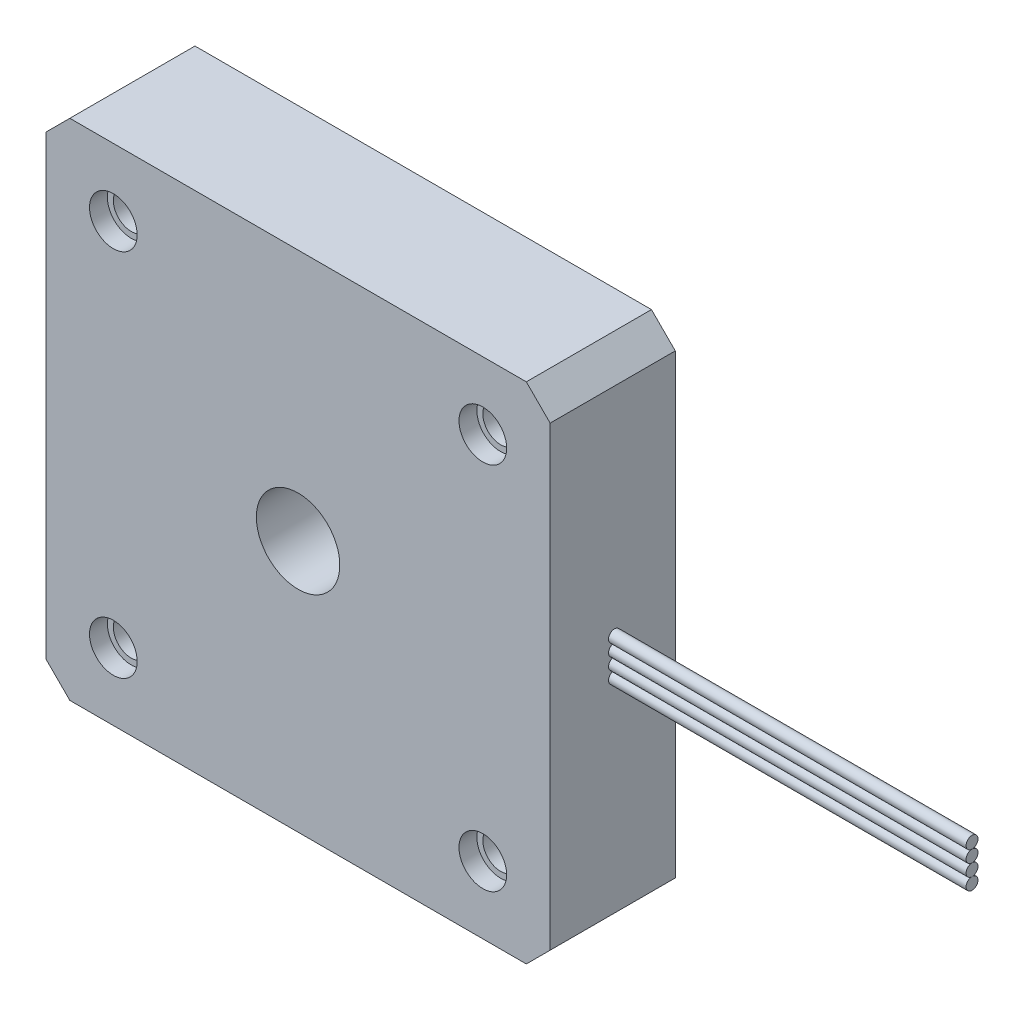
ISO-10303-21;
HEADER;
FILE_DESCRIPTION(('STEP AP214'),'2;1');
FILE_NAME('part.step','',(''),(''),'','','');
FILE_SCHEMA(('AUTOMOTIVE_DESIGN { 1 0 10303 214 1 1 1 1 }'));
ENDSEC;
DATA;
#1=APPLICATION_CONTEXT('core data for automotive mechanical design processes');
#2=APPLICATION_PROTOCOL_DEFINITION('international standard','automotive_design',2000,#1);
#3=PRODUCT_CONTEXT('',#1,'mechanical');
#4=PRODUCT('Part','Part','',(#3));
#5=PRODUCT_RELATED_PRODUCT_CATEGORY('part','',(#4));
#6=PRODUCT_DEFINITION_FORMATION('','',#4);
#7=PRODUCT_DEFINITION_CONTEXT('part definition',#1,'design');
#8=PRODUCT_DEFINITION('design','',#6,#7);
#9=PRODUCT_DEFINITION_SHAPE('','',#8);
#10=(LENGTH_UNIT() NAMED_UNIT(*) SI_UNIT(.MILLI.,.METRE.));
#11=(NAMED_UNIT(*) PLANE_ANGLE_UNIT() SI_UNIT($,.RADIAN.));
#12=(NAMED_UNIT(*) SI_UNIT($,.STERADIAN.) SOLID_ANGLE_UNIT());
#13=UNCERTAINTY_MEASURE_WITH_UNIT(LENGTH_MEASURE(1.E-05),#10,'distance_accuracy_value','');
#14=(GEOMETRIC_REPRESENTATION_CONTEXT(3) GLOBAL_UNCERTAINTY_ASSIGNED_CONTEXT((#13)) GLOBAL_UNIT_ASSIGNED_CONTEXT((#10,
#11,#12)) REPRESENTATION_CONTEXT('',''));
#15=CARTESIAN_POINT('',(0.,0.,0.));
#16=DIRECTION('',(0.,0.,1.));
#17=DIRECTION('',(1.,0.,0.));
#18=AXIS2_PLACEMENT_3D('',#15,#16,#17);
#19=CARTESIAN_POINT('',(51.15,-1.,5.10242147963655));
#20=DIRECTION('',(-1.,0.,0.));
#21=DIRECTION('',(0.,0.,1.));
#22=AXIS2_PLACEMENT_3D('',#19,#20,#21);
#23=CYLINDRICAL_SURFACE('',#22,0.500000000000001);
#24=CARTESIAN_POINT('',(51.15,-1.,5.10242147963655));
#25=DIRECTION('',(1.,0.,0.));
#26=DIRECTION('',(0.,0.,-1.));
#27=AXIS2_PLACEMENT_3D('',#24,#25,#26);
#28=CIRCLE('',#27,0.500000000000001);
#29=CARTESIAN_POINT('',(51.15,-1.,4.60242147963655));
#30=VERTEX_POINT('',#29);
#31=EDGE_CURVE('E11',#30,#30,#28,.T.);
#32=ORIENTED_EDGE('',*,*,#31,.F.);
#33=EDGE_LOOP('',(#32));
#34=FACE_BOUND('',#33,.T.);
#35=CARTESIAN_POINT('',(21.15,-1.,5.10242147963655));
#36=DIRECTION('',(1.,0.,0.));
#37=DIRECTION('',(0.,0.,-1.));
#38=AXIS2_PLACEMENT_3D('',#35,#36,#37);
#39=CIRCLE('',#38,0.500000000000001);
#40=CARTESIAN_POINT('',(21.15,-1.,4.60242147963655));
#41=VERTEX_POINT('',#40);
#42=EDGE_CURVE('E43',#41,#41,#39,.T.);
#43=ORIENTED_EDGE('',*,*,#42,.T.);
#44=EDGE_LOOP('',(#43));
#45=FACE_BOUND('',#44,.T.);
#46=ADVANCED_FACE('F40',(#34,#45),#23,.T.);
#47=CARTESIAN_POINT('',(51.15,-1.,5.10242147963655));
#48=DIRECTION('',(1.,0.,0.));
#49=DIRECTION('',(0.,0.,-1.));
#50=AXIS2_PLACEMENT_3D('',#47,#48,#49);
#51=PLANE('',#50);
#52=ORIENTED_EDGE('',*,*,#31,.T.);
#53=EDGE_LOOP('',(#52));
#54=FACE_BOUND('',#53,.T.);
#55=ADVANCED_FACE('F55',(#54),#51,.T.);
#56=CARTESIAN_POINT('',(21.15,-1.,5.10242147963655));
#57=DIRECTION('',(1.,0.,0.));
#58=DIRECTION('',(0.,0.,-1.));
#59=AXIS2_PLACEMENT_3D('',#56,#57,#58);
#60=PLANE('',#59);
#61=ORIENTED_EDGE('',*,*,#42,.F.);
#62=EDGE_LOOP('',(#61));
#63=FACE_BOUND('',#62,.T.);
#64=ADVANCED_FACE('F53',(#63),#60,.F.);
#65=CLOSED_SHELL('',(#46,#55,#64));
#66=MANIFOLD_SOLID_BREP('B2',#65);
#67=CARTESIAN_POINT('',(51.15,0.,5.10242147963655));
#68=DIRECTION('',(-1.,0.,0.));
#69=DIRECTION('',(0.,0.,1.));
#70=AXIS2_PLACEMENT_3D('',#67,#68,#69);
#71=CYLINDRICAL_SURFACE('',#70,0.500000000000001);
#72=CARTESIAN_POINT('',(51.15,0.,5.10242147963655));
#73=DIRECTION('',(1.,0.,0.));
#74=DIRECTION('',(0.,0.,-1.));
#75=AXIS2_PLACEMENT_3D('',#72,#73,#74);
#76=CIRCLE('',#75,0.500000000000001);
#77=CARTESIAN_POINT('',(51.15,0.,4.60242147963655));
#78=VERTEX_POINT('',#77);
#79=EDGE_CURVE('E39',#78,#78,#76,.T.);
#80=ORIENTED_EDGE('',*,*,#79,.F.);
#81=EDGE_LOOP('',(#80));
#82=FACE_BOUND('',#81,.T.);
#83=CARTESIAN_POINT('',(21.15,0.,5.10242147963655));
#84=DIRECTION('',(1.,0.,0.));
#85=DIRECTION('',(0.,0.,-1.));
#86=AXIS2_PLACEMENT_3D('',#83,#84,#85);
#87=CIRCLE('',#86,0.500000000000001);
#88=CARTESIAN_POINT('',(21.15,0.,4.60242147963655));
#89=VERTEX_POINT('',#88);
#90=EDGE_CURVE('E93',#89,#89,#87,.T.);
#91=ORIENTED_EDGE('',*,*,#90,.T.);
#92=EDGE_LOOP('',(#91));
#93=FACE_BOUND('',#92,.T.);
#94=ADVANCED_FACE('F90',(#82,#93),#71,.T.);
#95=CARTESIAN_POINT('',(51.15,0.,5.10242147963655));
#96=DIRECTION('',(1.,0.,0.));
#97=DIRECTION('',(0.,0.,-1.));
#98=AXIS2_PLACEMENT_3D('',#95,#96,#97);
#99=PLANE('',#98);
#100=ORIENTED_EDGE('',*,*,#79,.T.);
#101=EDGE_LOOP('',(#100));
#102=FACE_BOUND('',#101,.T.);
#103=ADVANCED_FACE('F105',(#102),#99,.T.);
#104=CARTESIAN_POINT('',(21.15,0.,5.10242147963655));
#105=DIRECTION('',(1.,0.,0.));
#106=DIRECTION('',(0.,0.,-1.));
#107=AXIS2_PLACEMENT_3D('',#104,#105,#106);
#108=PLANE('',#107);
#109=ORIENTED_EDGE('',*,*,#90,.F.);
#110=EDGE_LOOP('',(#109));
#111=FACE_BOUND('',#110,.T.);
#112=ADVANCED_FACE('F103',(#111),#108,.F.);
#113=CLOSED_SHELL('',(#94,#103,#112));
#114=MANIFOLD_SOLID_BREP('B6',#113);
#115=CARTESIAN_POINT('',(21.15,-19.15,10.5));
#116=DIRECTION('',(-1.,0.,0.));
#117=DIRECTION('',(0.,0.,1.));
#118=AXIS2_PLACEMENT_3D('',#115,#116,#117);
#119=PLANE('',#118);
#120=CARTESIAN_POINT('',(21.15,-2.,5.10242147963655));
#121=DIRECTION('',(-1.,0.,0.));
#122=DIRECTION('',(0.,0.,1.));
#123=AXIS2_PLACEMENT_3D('',#120,#121,#122);
#124=CIRCLE('',#123,0.500000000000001);
#125=CARTESIAN_POINT('',(21.15,-2.,5.60242147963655));
#126=VERTEX_POINT('',#125);
#127=EDGE_CURVE('E140',#126,#126,#124,.F.);
#128=ORIENTED_EDGE('',*,*,#127,.F.);
#129=EDGE_LOOP('',(#128));
#130=FACE_BOUND('',#129,.T.);
#131=DIRECTION('',(0.,1.,0.));
#132=VECTOR('',#131,1.);
#133=CARTESIAN_POINT('',(21.15,-19.15,0.));
#134=LINE('',#133,#132);
#135=CARTESIAN_POINT('',(21.15,-19.15,0.));
#136=VERTEX_POINT('',#135);
#137=CARTESIAN_POINT('',(21.15,19.15,0.));
#138=VERTEX_POINT('',#137);
#139=EDGE_CURVE('E239',#136,#138,#134,.T.);
#140=ORIENTED_EDGE('',*,*,#139,.T.);
#141=DIRECTION('',(0.,0.,-1.));
#142=VECTOR('',#141,1.);
#143=CARTESIAN_POINT('',(21.15,19.15,10.5));
#144=LINE('',#143,#142);
#145=CARTESIAN_POINT('',(21.15,19.15,10.5));
#146=VERTEX_POINT('',#145);
#147=EDGE_CURVE('E220',#146,#138,#144,.T.);
#148=ORIENTED_EDGE('',*,*,#147,.F.);
#149=DIRECTION('',(0.,1.,0.));
#150=VECTOR('',#149,1.);
#151=CARTESIAN_POINT('',(21.15,-19.15,10.5));
#152=LINE('',#151,#150);
#153=CARTESIAN_POINT('',(21.15,-19.15,10.5));
#154=VERTEX_POINT('',#153);
#155=EDGE_CURVE('E211',#154,#146,#152,.T.);
#156=ORIENTED_EDGE('',*,*,#155,.F.);
#157=DIRECTION('',(0.,0.,-1.));
#158=VECTOR('',#157,1.);
#159=CARTESIAN_POINT('',(21.15,-19.15,10.5));
#160=LINE('',#159,#158);
#161=EDGE_CURVE('E248',#154,#136,#160,.T.);
#162=ORIENTED_EDGE('',*,*,#161,.T.);
#163=EDGE_LOOP('',(#140,#148,#156,#162));
#164=FACE_BOUND('',#163,.T.);
#165=CARTESIAN_POINT('',(21.15,1.,5.10242147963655));
#166=DIRECTION('',(-1.,0.,0.));
#167=DIRECTION('',(0.,0.,1.));
#168=AXIS2_PLACEMENT_3D('',#165,#166,#167);
#169=CIRCLE('',#168,0.500000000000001);
#170=CARTESIAN_POINT('',(21.15,1.,5.60242147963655));
#171=VERTEX_POINT('',#170);
#172=EDGE_CURVE('E88',#171,#171,#169,.F.);
#173=ORIENTED_EDGE('',*,*,#172,.F.);
#174=EDGE_LOOP('',(#173));
#175=FACE_BOUND('',#174,.T.);
#176=ADVANCED_FACE('F131',(#130,#164,#175),#119,.F.);
#177=CARTESIAN_POINT('',(-21.15,-19.15,10.5));
#178=DIRECTION('',(1.,0.,0.));
#179=DIRECTION('',(0.,0.,-1.));
#180=AXIS2_PLACEMENT_3D('',#177,#178,#179);
#181=PLANE('',#180);
#182=DIRECTION('',(0.,-1.,0.));
#183=VECTOR('',#182,1.);
#184=CARTESIAN_POINT('',(-21.15,-19.15,0.));
#185=LINE('',#184,#183);
#186=CARTESIAN_POINT('',(-21.15,19.15,0.));
#187=VERTEX_POINT('',#186);
#188=CARTESIAN_POINT('',(-21.15,-19.15,0.));
#189=VERTEX_POINT('',#188);
#190=EDGE_CURVE('E229',#187,#189,#185,.T.);
#191=ORIENTED_EDGE('',*,*,#190,.T.);
#192=DIRECTION('',(0.,0.,-1.));
#193=VECTOR('',#192,1.);
#194=CARTESIAN_POINT('',(-21.15,-19.15,10.5));
#195=LINE('',#194,#193);
#196=CARTESIAN_POINT('',(-21.15,-19.15,10.5));
#197=VERTEX_POINT('',#196);
#198=EDGE_CURVE('E257',#197,#189,#195,.T.);
#199=ORIENTED_EDGE('',*,*,#198,.F.);
#200=DIRECTION('',(0.,-1.,0.));
#201=VECTOR('',#200,1.);
#202=CARTESIAN_POINT('',(-21.15,-19.15,10.5));
#203=LINE('',#202,#201);
#204=CARTESIAN_POINT('',(-21.15,19.15,10.5));
#205=VERTEX_POINT('',#204);
#206=EDGE_CURVE('E244',#205,#197,#203,.T.);
#207=ORIENTED_EDGE('',*,*,#206,.F.);
#208=DIRECTION('',(0.,0.,-1.));
#209=VECTOR('',#208,1.);
#210=CARTESIAN_POINT('',(-21.15,19.15,10.5));
#211=LINE('',#210,#209);
#212=EDGE_CURVE('E225',#205,#187,#211,.T.);
#213=ORIENTED_EDGE('',*,*,#212,.T.);
#214=EDGE_LOOP('',(#191,#199,#207,#213));
#215=FACE_BOUND('',#214,.T.);
#216=ADVANCED_FACE('F133',(#215),#181,.F.);
#217=CARTESIAN_POINT('',(-21.15,-19.15,10.5));
#218=DIRECTION('',(0.707106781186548,0.707106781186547,0.));
#219=DIRECTION('',(-0.707106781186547,0.707106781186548,0.));
#220=AXIS2_PLACEMENT_3D('',#217,#218,#219);
#221=PLANE('',#220);
#222=DIRECTION('',(0.707106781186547,-0.707106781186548,0.));
#223=VECTOR('',#222,1.);
#224=CARTESIAN_POINT('',(-21.15,-19.15,0.));
#225=LINE('',#224,#223);
#226=CARTESIAN_POINT('',(-19.15,-21.15,0.));
#227=VERTEX_POINT('',#226);
#228=EDGE_CURVE('E232',#189,#227,#225,.T.);
#229=ORIENTED_EDGE('',*,*,#228,.T.);
#230=DIRECTION('',(0.,0.,-1.));
#231=VECTOR('',#230,1.);
#232=CARTESIAN_POINT('',(-19.15,-21.15,10.5));
#233=LINE('',#232,#231);
#234=CARTESIAN_POINT('',(-19.15,-21.15,10.5));
#235=VERTEX_POINT('',#234);
#236=EDGE_CURVE('E254',#235,#227,#233,.T.);
#237=ORIENTED_EDGE('',*,*,#236,.F.);
#238=DIRECTION('',(0.707106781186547,-0.707106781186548,0.));
#239=VECTOR('',#238,1.);
#240=CARTESIAN_POINT('',(-21.15,-19.15,10.5));
#241=LINE('',#240,#239);
#242=EDGE_CURVE('E192',#197,#235,#241,.T.);
#243=ORIENTED_EDGE('',*,*,#242,.F.);
#244=ORIENTED_EDGE('',*,*,#198,.T.);
#245=EDGE_LOOP('',(#229,#237,#243,#244));
#246=FACE_BOUND('',#245,.T.);
#247=ADVANCED_FACE('F372',(#246),#221,.F.);
#248=CARTESIAN_POINT('',(19.15,-21.15,10.5));
#249=DIRECTION('',(0.,1.,0.));
#250=DIRECTION('',(-1.,0.,0.));
#251=AXIS2_PLACEMENT_3D('',#248,#249,#250);
#252=PLANE('',#251);
#253=DIRECTION('',(1.,0.,0.));
#254=VECTOR('',#253,1.);
#255=CARTESIAN_POINT('',(19.15,-21.15,0.));
#256=LINE('',#255,#254);
#257=CARTESIAN_POINT('',(19.15,-21.15,0.));
#258=VERTEX_POINT('',#257);
#259=EDGE_CURVE('E235',#227,#258,#256,.T.);
#260=ORIENTED_EDGE('',*,*,#259,.T.);
#261=DIRECTION('',(0.,0.,-1.));
#262=VECTOR('',#261,1.);
#263=CARTESIAN_POINT('',(19.15,-21.15,10.5));
#264=LINE('',#263,#262);
#265=CARTESIAN_POINT('',(19.15,-21.15,10.5));
#266=VERTEX_POINT('',#265);
#267=EDGE_CURVE('E251',#266,#258,#264,.T.);
#268=ORIENTED_EDGE('',*,*,#267,.F.);
#269=DIRECTION('',(1.,0.,0.));
#270=VECTOR('',#269,1.);
#271=CARTESIAN_POINT('',(19.15,-21.15,10.5));
#272=LINE('',#271,#270);
#273=EDGE_CURVE('E385',#235,#266,#272,.T.);
#274=ORIENTED_EDGE('',*,*,#273,.F.);
#275=ORIENTED_EDGE('',*,*,#236,.T.);
#276=EDGE_LOOP('',(#260,#268,#274,#275));
#277=FACE_BOUND('',#276,.T.);
#278=ADVANCED_FACE('F369',(#277),#252,.F.);
#279=CARTESIAN_POINT('',(21.15,-19.15,10.5));
#280=DIRECTION('',(-0.707106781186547,0.707106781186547,0.));
#281=DIRECTION('',(-0.707106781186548,-0.707106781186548,0.));
#282=AXIS2_PLACEMENT_3D('',#279,#280,#281);
#283=PLANE('',#282);
#284=DIRECTION('',(0.707106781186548,0.707106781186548,0.));
#285=VECTOR('',#284,1.);
#286=CARTESIAN_POINT('',(21.15,-19.15,0.));
#287=LINE('',#286,#285);
#288=EDGE_CURVE('E237',#258,#136,#287,.T.);
#289=ORIENTED_EDGE('',*,*,#288,.T.);
#290=ORIENTED_EDGE('',*,*,#161,.F.);
#291=DIRECTION('',(0.707106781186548,0.707106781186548,0.));
#292=VECTOR('',#291,1.);
#293=CARTESIAN_POINT('',(21.15,-19.15,10.5));
#294=LINE('',#293,#292);
#295=EDGE_CURVE('E389',#266,#154,#294,.T.);
#296=ORIENTED_EDGE('',*,*,#295,.F.);
#297=ORIENTED_EDGE('',*,*,#267,.T.);
#298=EDGE_LOOP('',(#289,#290,#296,#297));
#299=FACE_BOUND('',#298,.T.);
#300=ADVANCED_FACE('F365',(#299),#283,.F.);
#301=CARTESIAN_POINT('',(19.15,21.15,10.5));
#302=DIRECTION('',(-0.707106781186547,-0.707106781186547,0.));
#303=DIRECTION('',(0.707106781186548,-0.707106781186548,0.));
#304=AXIS2_PLACEMENT_3D('',#301,#302,#303);
#305=PLANE('',#304);
#306=DIRECTION('',(-0.707106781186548,0.707106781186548,0.));
#307=VECTOR('',#306,1.);
#308=CARTESIAN_POINT('',(19.15,21.15,0.));
#309=LINE('',#308,#307);
#310=CARTESIAN_POINT('',(19.15,21.15,0.));
#311=VERTEX_POINT('',#310);
#312=EDGE_CURVE('E219',#138,#311,#309,.T.);
#313=ORIENTED_EDGE('',*,*,#312,.T.);
#314=DIRECTION('',(0.,0.,-1.));
#315=VECTOR('',#314,1.);
#316=CARTESIAN_POINT('',(19.15,21.15,10.5));
#317=LINE('',#316,#315);
#318=CARTESIAN_POINT('',(19.15,21.15,10.5));
#319=VERTEX_POINT('',#318);
#320=EDGE_CURVE('E216',#319,#311,#317,.T.);
#321=ORIENTED_EDGE('',*,*,#320,.F.);
#322=DIRECTION('',(-0.707106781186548,0.707106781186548,0.));
#323=VECTOR('',#322,1.);
#324=CARTESIAN_POINT('',(19.15,21.15,10.5));
#325=LINE('',#324,#323);
#326=EDGE_CURVE('E205',#146,#319,#325,.T.);
#327=ORIENTED_EDGE('',*,*,#326,.F.);
#328=ORIENTED_EDGE('',*,*,#147,.T.);
#329=EDGE_LOOP('',(#313,#321,#327,#328));
#330=FACE_BOUND('',#329,.T.);
#331=ADVANCED_FACE('F217',(#330),#305,.F.);
#332=CARTESIAN_POINT('',(19.15,21.15,10.5));
#333=DIRECTION('',(0.,-1.,0.));
#334=DIRECTION('',(1.,0.,0.));
#335=AXIS2_PLACEMENT_3D('',#332,#333,#334);
#336=PLANE('',#335);
#337=DIRECTION('',(-1.,0.,0.));
#338=VECTOR('',#337,1.);
#339=CARTESIAN_POINT('',(19.15,21.15,0.));
#340=LINE('',#339,#338);
#341=CARTESIAN_POINT('',(-19.15,21.15,0.));
#342=VERTEX_POINT('',#341);
#343=EDGE_CURVE('E177',#311,#342,#340,.T.);
#344=ORIENTED_EDGE('',*,*,#343,.T.);
#345=DIRECTION('',(0.,0.,-1.));
#346=VECTOR('',#345,1.);
#347=CARTESIAN_POINT('',(-19.15,21.15,10.5));
#348=LINE('',#347,#346);
#349=CARTESIAN_POINT('',(-19.15,21.15,10.5));
#350=VERTEX_POINT('',#349);
#351=EDGE_CURVE('E221',#350,#342,#348,.T.);
#352=ORIENTED_EDGE('',*,*,#351,.F.);
#353=DIRECTION('',(-1.,0.,0.));
#354=VECTOR('',#353,1.);
#355=CARTESIAN_POINT('',(19.15,21.15,10.5));
#356=LINE('',#355,#354);
#357=EDGE_CURVE('E209',#319,#350,#356,.T.);
#358=ORIENTED_EDGE('',*,*,#357,.F.);
#359=ORIENTED_EDGE('',*,*,#320,.T.);
#360=EDGE_LOOP('',(#344,#352,#358,#359));
#361=FACE_BOUND('',#360,.T.);
#362=ADVANCED_FACE('F223',(#361),#336,.F.);
#363=CARTESIAN_POINT('',(-19.15,21.15,10.5));
#364=DIRECTION('',(0.707106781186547,-0.707106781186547,0.));
#365=DIRECTION('',(0.707106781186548,0.707106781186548,0.));
#366=AXIS2_PLACEMENT_3D('',#363,#364,#365);
#367=PLANE('',#366);
#368=DIRECTION('',(-0.707106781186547,-0.707106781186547,0.));
#369=VECTOR('',#368,1.);
#370=CARTESIAN_POINT('',(-19.15,21.15,0.));
#371=LINE('',#370,#369);
#372=EDGE_CURVE('E183',#342,#187,#371,.T.);
#373=ORIENTED_EDGE('',*,*,#372,.T.);
#374=ORIENTED_EDGE('',*,*,#212,.F.);
#375=DIRECTION('',(-0.707106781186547,-0.707106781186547,0.));
#376=VECTOR('',#375,1.);
#377=CARTESIAN_POINT('',(-19.15,21.15,10.5));
#378=LINE('',#377,#376);
#379=EDGE_CURVE('E148',#350,#205,#378,.T.);
#380=ORIENTED_EDGE('',*,*,#379,.F.);
#381=ORIENTED_EDGE('',*,*,#351,.T.);
#382=EDGE_LOOP('',(#373,#374,#380,#381));
#383=FACE_BOUND('',#382,.T.);
#384=ADVANCED_FACE('F355',(#383),#367,.F.);
#385=CARTESIAN_POINT('',(0.,0.,10.5));
#386=DIRECTION('',(0.,0.,1.));
#387=DIRECTION('',(1.,0.,0.));
#388=AXIS2_PLACEMENT_3D('',#385,#386,#387);
#389=PLANE('',#388);
#390=CARTESIAN_POINT('',(-15.5000000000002,-15.4999999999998,10.5));
#391=DIRECTION('',(0.,0.,1.));
#392=DIRECTION('',(0.,1.,0.));
#393=AXIS2_PLACEMENT_3D('',#390,#391,#392);
#394=CIRCLE('',#393,2.);
#395=CARTESIAN_POINT('',(-15.5000000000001,-13.4999999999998,10.5));
#396=VERTEX_POINT('',#395);
#397=EDGE_CURVE('E432',#396,#396,#394,.T.);
#398=ORIENTED_EDGE('',*,*,#397,.F.);
#399=EDGE_LOOP('',(#398));
#400=FACE_BOUND('',#399,.T.);
#401=CARTESIAN_POINT('',(15.5,-15.5,10.5));
#402=DIRECTION('',(0.,0.,1.));
#403=DIRECTION('',(-1.,0.,0.));
#404=AXIS2_PLACEMENT_3D('',#401,#402,#403);
#405=CIRCLE('',#404,2.);
#406=CARTESIAN_POINT('',(13.5,-15.5,10.5));
#407=VERTEX_POINT('',#406);
#408=EDGE_CURVE('E423',#407,#407,#405,.T.);
#409=ORIENTED_EDGE('',*,*,#408,.F.);
#410=EDGE_LOOP('',(#409));
#411=FACE_BOUND('',#410,.T.);
#412=CARTESIAN_POINT('',(15.5,15.4999999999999,10.5));
#413=DIRECTION('',(0.,0.,1.));
#414=DIRECTION('',(0.,-1.,0.));
#415=AXIS2_PLACEMENT_3D('',#412,#413,#414);
#416=CIRCLE('',#415,2.);
#417=CARTESIAN_POINT('',(15.5,13.4999999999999,10.5));
#418=VERTEX_POINT('',#417);
#419=EDGE_CURVE('E414',#418,#418,#416,.T.);
#420=ORIENTED_EDGE('',*,*,#419,.F.);
#421=EDGE_LOOP('',(#420));
#422=FACE_BOUND('',#421,.T.);
#423=CARTESIAN_POINT('',(-15.5,15.5,10.5));
#424=DIRECTION('',(0.,0.,1.));
#425=DIRECTION('',(1.,0.,0.));
#426=AXIS2_PLACEMENT_3D('',#423,#424,#425);
#427=CIRCLE('',#426,2.);
#428=CARTESIAN_POINT('',(-13.5,15.5,10.5));
#429=VERTEX_POINT('',#428);
#430=EDGE_CURVE('E401',#429,#429,#427,.T.);
#431=ORIENTED_EDGE('',*,*,#430,.F.);
#432=EDGE_LOOP('',(#431));
#433=FACE_BOUND('',#432,.T.);
#434=CARTESIAN_POINT('',(0.,0.,10.5));
#435=DIRECTION('',(0.,0.,-1.));
#436=DIRECTION('',(-1.,0.,0.));
#437=AXIS2_PLACEMENT_3D('',#434,#435,#436);
#438=CIRCLE('',#437,3.5);
#439=CARTESIAN_POINT('',(-3.5,0.,10.5));
#440=VERTEX_POINT('',#439);
#441=EDGE_CURVE('E233',#440,#440,#438,.T.);
#442=ORIENTED_EDGE('',*,*,#441,.T.);
#443=EDGE_LOOP('',(#442));
#444=FACE_BOUND('',#443,.T.);
#445=ORIENTED_EDGE('',*,*,#206,.T.);
#446=ORIENTED_EDGE('',*,*,#242,.T.);
#447=ORIENTED_EDGE('',*,*,#273,.T.);
#448=ORIENTED_EDGE('',*,*,#295,.T.);
#449=ORIENTED_EDGE('',*,*,#155,.T.);
#450=ORIENTED_EDGE('',*,*,#326,.T.);
#451=ORIENTED_EDGE('',*,*,#357,.T.);
#452=ORIENTED_EDGE('',*,*,#379,.T.);
#453=EDGE_LOOP('',(#445,#446,#447,#448,#449,#450,#451,#452));
#454=FACE_BOUND('',#453,.T.);
#455=ADVANCED_FACE('F207',(#400,#411,#422,#433,#444,#454),#389,.T.);
#456=CARTESIAN_POINT('',(0.,0.,0.));
#457=DIRECTION('',(0.,0.,1.));
#458=DIRECTION('',(1.,0.,0.));
#459=AXIS2_PLACEMENT_3D('',#456,#457,#458);
#460=PLANE('',#459);
#461=CARTESIAN_POINT('',(-15.5000000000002,-15.4999999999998,0.));
#462=DIRECTION('',(0.,0.,1.));
#463=DIRECTION('',(1.,0.,0.));
#464=AXIS2_PLACEMENT_3D('',#461,#462,#463);
#465=CIRCLE('',#464,1.5);
#466=CARTESIAN_POINT('',(-14.0000000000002,-15.4999999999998,0.));
#467=VERTEX_POINT('',#466);
#468=EDGE_CURVE('E266',#467,#467,#465,.T.);
#469=ORIENTED_EDGE('',*,*,#468,.T.);
#470=EDGE_LOOP('',(#469));
#471=FACE_BOUND('',#470,.T.);
#472=CARTESIAN_POINT('',(15.5,-15.5,0.));
#473=DIRECTION('',(0.,0.,1.));
#474=DIRECTION('',(1.,0.,0.));
#475=AXIS2_PLACEMENT_3D('',#472,#473,#474);
#476=CIRCLE('',#475,1.5);
#477=CARTESIAN_POINT('',(17.,-15.5,0.));
#478=VERTEX_POINT('',#477);
#479=EDGE_CURVE('E263',#478,#478,#476,.T.);
#480=ORIENTED_EDGE('',*,*,#479,.T.);
#481=EDGE_LOOP('',(#480));
#482=FACE_BOUND('',#481,.T.);
#483=CARTESIAN_POINT('',(15.5,15.4999999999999,0.));
#484=DIRECTION('',(0.,0.,1.));
#485=DIRECTION('',(1.,0.,0.));
#486=AXIS2_PLACEMENT_3D('',#483,#484,#485);
#487=CIRCLE('',#486,1.5);
#488=CARTESIAN_POINT('',(17.,15.4999999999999,0.));
#489=VERTEX_POINT('',#488);
#490=EDGE_CURVE('E259',#489,#489,#487,.T.);
#491=ORIENTED_EDGE('',*,*,#490,.T.);
#492=EDGE_LOOP('',(#491));
#493=FACE_BOUND('',#492,.T.);
#494=CARTESIAN_POINT('',(-15.5,15.5,0.));
#495=DIRECTION('',(0.,0.,1.));
#496=DIRECTION('',(1.,0.,0.));
#497=AXIS2_PLACEMENT_3D('',#494,#495,#496);
#498=CIRCLE('',#497,1.5);
#499=CARTESIAN_POINT('',(-14.,15.5,0.));
#500=VERTEX_POINT('',#499);
#501=EDGE_CURVE('E404',#500,#500,#498,.T.);
#502=ORIENTED_EDGE('',*,*,#501,.T.);
#503=EDGE_LOOP('',(#502));
#504=FACE_BOUND('',#503,.T.);
#505=CARTESIAN_POINT('',(0.,0.,0.));
#506=DIRECTION('',(0.,0.,-1.));
#507=DIRECTION('',(-1.,0.,0.));
#508=AXIS2_PLACEMENT_3D('',#505,#506,#507);
#509=CIRCLE('',#508,3.5);
#510=CARTESIAN_POINT('',(-3.5,0.,0.));
#511=VERTEX_POINT('',#510);
#512=EDGE_CURVE('E395',#511,#511,#509,.T.);
#513=ORIENTED_EDGE('',*,*,#512,.F.);
#514=EDGE_LOOP('',(#513));
#515=FACE_BOUND('',#514,.T.);
#516=ORIENTED_EDGE('',*,*,#190,.F.);
#517=ORIENTED_EDGE('',*,*,#372,.F.);
#518=ORIENTED_EDGE('',*,*,#343,.F.);
#519=ORIENTED_EDGE('',*,*,#312,.F.);
#520=ORIENTED_EDGE('',*,*,#139,.F.);
#521=ORIENTED_EDGE('',*,*,#288,.F.);
#522=ORIENTED_EDGE('',*,*,#259,.F.);
#523=ORIENTED_EDGE('',*,*,#228,.F.);
#524=EDGE_LOOP('',(#516,#517,#518,#519,#520,#521,#522,#523));
#525=FACE_BOUND('',#524,.T.);
#526=ADVANCED_FACE('F351',(#471,#482,#493,#504,#515,#525),#460,.F.);
#527=CARTESIAN_POINT('',(0.,0.,10.5));
#528=DIRECTION('',(0.,0.,-1.));
#529=DIRECTION('',(-1.,0.,0.));
#530=AXIS2_PLACEMENT_3D('',#527,#528,#529);
#531=CYLINDRICAL_SURFACE('',#530,3.5);
#532=CARTESIAN_POINT('',(-3.5,0.,10.5));
#533=CARTESIAN_POINT('',(-3.5,0.,10.390625));
#534=CARTESIAN_POINT('',(-3.5,0.,10.28125));
#535=CARTESIAN_POINT('',(-3.5,0.,10.0625));
#536=CARTESIAN_POINT('',(-3.5,0.,9.953125));
#537=CARTESIAN_POINT('',(-3.5,0.,9.734375));
#538=CARTESIAN_POINT('',(-3.5,0.,9.625));
#539=CARTESIAN_POINT('',(-3.5,0.,9.40625));
#540=CARTESIAN_POINT('',(-3.5,0.,9.296875));
#541=CARTESIAN_POINT('',(-3.5,0.,9.078125));
#542=CARTESIAN_POINT('',(-3.5,0.,8.96875));
#543=CARTESIAN_POINT('',(-3.5,0.,8.75));
#544=CARTESIAN_POINT('',(-3.5,0.,8.640625));
#545=CARTESIAN_POINT('',(-3.5,0.,8.421875));
#546=CARTESIAN_POINT('',(-3.5,0.,8.3125));
#547=CARTESIAN_POINT('',(-3.5,0.,8.09375));
#548=CARTESIAN_POINT('',(-3.5,0.,7.984375));
#549=CARTESIAN_POINT('',(-3.5,0.,7.765625));
#550=CARTESIAN_POINT('',(-3.5,0.,7.65625));
#551=CARTESIAN_POINT('',(-3.5,0.,7.4375));
#552=CARTESIAN_POINT('',(-3.5,0.,7.328125));
#553=CARTESIAN_POINT('',(-3.5,0.,7.109375));
#554=CARTESIAN_POINT('',(-3.5,0.,7.));
#555=CARTESIAN_POINT('',(-3.5,0.,6.78125));
#556=CARTESIAN_POINT('',(-3.5,0.,6.671875));
#557=CARTESIAN_POINT('',(-3.5,0.,6.453125));
#558=CARTESIAN_POINT('',(-3.5,0.,6.34375));
#559=CARTESIAN_POINT('',(-3.5,0.,6.125));
#560=CARTESIAN_POINT('',(-3.5,0.,6.015625));
#561=CARTESIAN_POINT('',(-3.5,0.,5.796875));
#562=CARTESIAN_POINT('',(-3.5,0.,5.6875));
#563=CARTESIAN_POINT('',(-3.5,0.,5.46875));
#564=CARTESIAN_POINT('',(-3.5,0.,5.359375));
#565=CARTESIAN_POINT('',(-3.5,0.,5.140625));
#566=CARTESIAN_POINT('',(-3.5,0.,5.03125));
#567=CARTESIAN_POINT('',(-3.5,0.,4.8125));
#568=CARTESIAN_POINT('',(-3.5,0.,4.703125));
#569=CARTESIAN_POINT('',(-3.5,0.,4.484375));
#570=CARTESIAN_POINT('',(-3.5,0.,4.375));
#571=CARTESIAN_POINT('',(-3.5,0.,4.15625));
#572=CARTESIAN_POINT('',(-3.5,0.,4.046875));
#573=CARTESIAN_POINT('',(-3.5,0.,3.828125));
#574=CARTESIAN_POINT('',(-3.5,0.,3.71875));
#575=CARTESIAN_POINT('',(-3.5,0.,3.5));
#576=CARTESIAN_POINT('',(-3.5,0.,3.390625));
#577=CARTESIAN_POINT('',(-3.5,0.,3.171875));
#578=CARTESIAN_POINT('',(-3.5,0.,3.0625));
#579=CARTESIAN_POINT('',(-3.5,0.,2.84375));
#580=CARTESIAN_POINT('',(-3.5,0.,2.734375));
#581=CARTESIAN_POINT('',(-3.5,0.,2.515625));
#582=CARTESIAN_POINT('',(-3.5,0.,2.40625));
#583=CARTESIAN_POINT('',(-3.5,0.,2.1875));
#584=CARTESIAN_POINT('',(-3.5,0.,2.078125));
#585=CARTESIAN_POINT('',(-3.5,0.,1.859375));
#586=CARTESIAN_POINT('',(-3.5,0.,1.75));
#587=CARTESIAN_POINT('',(-3.5,0.,1.53125));
#588=CARTESIAN_POINT('',(-3.5,0.,1.421875));
#589=CARTESIAN_POINT('',(-3.5,0.,1.203125));
#590=CARTESIAN_POINT('',(-3.5,0.,1.09375));
#591=CARTESIAN_POINT('',(-3.5,0.,0.875000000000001));
#592=CARTESIAN_POINT('',(-3.5,0.,0.765625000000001));
#593=CARTESIAN_POINT('',(-3.5,0.,0.546875));
#594=CARTESIAN_POINT('',(-3.5,0.,0.4375));
#595=CARTESIAN_POINT('',(-3.5,0.,0.21875));
#596=CARTESIAN_POINT('',(-3.5,0.,0.109375));
#597=CARTESIAN_POINT('',(-3.5,0.,0.));
#598=B_SPLINE_CURVE_WITH_KNOTS('',3,(#532,#533,#534,#535,#536,#537,#538,#539,#540,#541,#542,
#543,#544,#545,#546,#547,#548,#549,#550,#551,#552,#553,#554,#555,#556,#557,#558,#559,#560,#561,
#562,#563,#564,#565,#566,#567,#568,#569,#570,#571,#572,#573,#574,#575,#576,#577,#578,#579,#580,
#581,#582,#583,#584,#585,#586,#587,#588,#589,#590,#591,#592,#593,#594,#595,#596,#597),
.UNSPECIFIED.,.F.,.F.,(4,2,2,2,2,2,2,2,2,2,2,2,2,2,2,2,2,2,2,2,2,2,2,2,2,2,2,2,2,2,2,2,4),(0.,
0.328124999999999,0.656249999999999,0.984374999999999,1.3125,1.640625,1.96875,2.296875,2.625,
2.953125,3.28125,3.609375,3.9375,4.265625,4.59375,4.921875,5.25,5.578125,5.90625,6.234375,
6.5625,6.890625,7.21875,7.546875,7.875,8.203125,8.53125,8.859375,9.1875,9.515625,9.84375,
10.171875,10.5),.UNSPECIFIED.);
#599=EDGE_CURVE('BSEAM347',#440,#511,#598,.T.);
#600=ORIENTED_EDGE('',*,*,#441,.F.);
#601=ORIENTED_EDGE('',*,*,#512,.T.);
#602=ORIENTED_EDGE('',*,*,#599,.T.);
#603=ORIENTED_EDGE('',*,*,#599,.F.);
#604=EDGE_LOOP('',(#600,#602,#601,#603));
#605=FACE_BOUND('',#604,.T.);
#606=ADVANCED_FACE('F347',(#605),#531,.F.);
#607=CARTESIAN_POINT('',(-15.5,15.5,9.));
#608=DIRECTION('',(0.,0.,1.));
#609=DIRECTION('',(1.,0.,0.));
#610=AXIS2_PLACEMENT_3D('',#607,#608,#609);
#611=CYLINDRICAL_SURFACE('',#610,2.);
#612=CARTESIAN_POINT('',(-15.5,15.5,9.));
#613=DIRECTION('',(0.,0.,1.));
#614=DIRECTION('',(1.,0.,0.));
#615=AXIS2_PLACEMENT_3D('',#612,#613,#614);
#616=CIRCLE('',#615,2.);
#617=CARTESIAN_POINT('',(-13.5,15.5,9.));
#618=VERTEX_POINT('',#617);
#619=EDGE_CURVE('E398',#618,#618,#616,.T.);
#620=ORIENTED_EDGE('',*,*,#619,.F.);
#621=EDGE_LOOP('',(#620));
#622=FACE_BOUND('',#621,.T.);
#623=ORIENTED_EDGE('',*,*,#430,.T.);
#624=EDGE_LOOP('',(#623));
#625=FACE_BOUND('',#624,.T.);
#626=ADVANCED_FACE('F343',(#622,#625),#611,.F.);
#627=CARTESIAN_POINT('',(0.,0.,9.));
#628=DIRECTION('',(0.,0.,1.));
#629=DIRECTION('',(1.,0.,0.));
#630=AXIS2_PLACEMENT_3D('',#627,#628,#629);
#631=PLANE('',#630);
#632=CARTESIAN_POINT('',(-15.5,15.5,9.));
#633=DIRECTION('',(0.,0.,1.));
#634=DIRECTION('',(1.,0.,0.));
#635=AXIS2_PLACEMENT_3D('',#632,#633,#634);
#636=CIRCLE('',#635,1.5);
#637=CARTESIAN_POINT('',(-14.,15.5,9.));
#638=VERTEX_POINT('',#637);
#639=EDGE_CURVE('E262',#638,#638,#636,.T.);
#640=ORIENTED_EDGE('',*,*,#639,.F.);
#641=EDGE_LOOP('',(#640));
#642=FACE_BOUND('',#641,.T.);
#643=ORIENTED_EDGE('',*,*,#619,.T.);
#644=EDGE_LOOP('',(#643));
#645=FACE_BOUND('',#644,.T.);
#646=ADVANCED_FACE('F339',(#642,#645),#631,.T.);
#647=CARTESIAN_POINT('',(-15.5,15.5,-41.));
#648=DIRECTION('',(0.,0.,1.));
#649=DIRECTION('',(1.,0.,0.));
#650=AXIS2_PLACEMENT_3D('',#647,#648,#649);
#651=CYLINDRICAL_SURFACE('',#650,1.5);
#652=ORIENTED_EDGE('',*,*,#639,.T.);
#653=EDGE_LOOP('',(#652));
#654=FACE_BOUND('',#653,.T.);
#655=ORIENTED_EDGE('',*,*,#501,.F.);
#656=EDGE_LOOP('',(#655));
#657=FACE_BOUND('',#656,.T.);
#658=ADVANCED_FACE('F335',(#654,#657),#651,.F.);
#659=CARTESIAN_POINT('',(15.5,15.4999999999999,-41.));
#660=DIRECTION('',(0.,0.,1.));
#661=DIRECTION('',(1.,0.,0.));
#662=AXIS2_PLACEMENT_3D('',#659,#660,#661);
#663=CYLINDRICAL_SURFACE('',#662,1.5);
#664=CARTESIAN_POINT('',(15.5,15.4999999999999,9.));
#665=DIRECTION('',(0.,0.,1.));
#666=DIRECTION('',(1.,0.,0.));
#667=AXIS2_PLACEMENT_3D('',#664,#665,#666);
#668=CIRCLE('',#667,1.5);
#669=CARTESIAN_POINT('',(17.,15.4999999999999,9.));
#670=VERTEX_POINT('',#669);
#671=EDGE_CURVE('E268',#670,#670,#668,.F.);
#672=ORIENTED_EDGE('',*,*,#671,.F.);
#673=EDGE_LOOP('',(#672));
#674=FACE_BOUND('',#673,.T.);
#675=ORIENTED_EDGE('',*,*,#490,.F.);
#676=EDGE_LOOP('',(#675));
#677=FACE_BOUND('',#676,.T.);
#678=ADVANCED_FACE('F331',(#674,#677),#663,.F.);
#679=CARTESIAN_POINT('',(15.5,-15.5,-41.));
#680=DIRECTION('',(0.,0.,1.));
#681=DIRECTION('',(1.,0.,0.));
#682=AXIS2_PLACEMENT_3D('',#679,#680,#681);
#683=CYLINDRICAL_SURFACE('',#682,1.5);
#684=CARTESIAN_POINT('',(15.5,-15.5,9.));
#685=DIRECTION('',(0.,0.,1.));
#686=DIRECTION('',(1.,0.,0.));
#687=AXIS2_PLACEMENT_3D('',#684,#685,#686);
#688=CIRCLE('',#687,1.5);
#689=CARTESIAN_POINT('',(17.,-15.5,9.));
#690=VERTEX_POINT('',#689);
#691=EDGE_CURVE('E417',#690,#690,#688,.F.);
#692=ORIENTED_EDGE('',*,*,#691,.F.);
#693=EDGE_LOOP('',(#692));
#694=FACE_BOUND('',#693,.T.);
#695=ORIENTED_EDGE('',*,*,#479,.F.);
#696=EDGE_LOOP('',(#695));
#697=FACE_BOUND('',#696,.T.);
#698=ADVANCED_FACE('F327',(#694,#697),#683,.F.);
#699=CARTESIAN_POINT('',(-15.5000000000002,-15.4999999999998,-41.));
#700=DIRECTION('',(0.,0.,1.));
#701=DIRECTION('',(1.,0.,0.));
#702=AXIS2_PLACEMENT_3D('',#699,#700,#701);
#703=CYLINDRICAL_SURFACE('',#702,1.5);
#704=CARTESIAN_POINT('',(-15.5000000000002,-15.4999999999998,9.));
#705=DIRECTION('',(0.,0.,1.));
#706=DIRECTION('',(1.,0.,0.));
#707=AXIS2_PLACEMENT_3D('',#704,#705,#706);
#708=CIRCLE('',#707,1.5);
#709=CARTESIAN_POINT('',(-14.0000000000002,-15.4999999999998,9.));
#710=VERTEX_POINT('',#709);
#711=EDGE_CURVE('E426',#710,#710,#708,.F.);
#712=ORIENTED_EDGE('',*,*,#711,.F.);
#713=EDGE_LOOP('',(#712));
#714=FACE_BOUND('',#713,.T.);
#715=ORIENTED_EDGE('',*,*,#468,.F.);
#716=EDGE_LOOP('',(#715));
#717=FACE_BOUND('',#716,.T.);
#718=ADVANCED_FACE('F320',(#714,#717),#703,.F.);
#719=CARTESIAN_POINT('',(0.,0.,9.));
#720=DIRECTION('',(0.,0.,1.));
#721=DIRECTION('',(0.,-1.,0.));
#722=AXIS2_PLACEMENT_3D('',#719,#720,#721);
#723=PLANE('',#722);
#724=CARTESIAN_POINT('',(15.5,15.4999999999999,9.));
#725=DIRECTION('',(0.,0.,1.));
#726=DIRECTION('',(0.,-1.,0.));
#727=AXIS2_PLACEMENT_3D('',#724,#725,#726);
#728=CIRCLE('',#727,2.);
#729=CARTESIAN_POINT('',(15.5,13.4999999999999,9.));
#730=VERTEX_POINT('',#729);
#731=EDGE_CURVE('E413',#730,#730,#728,.T.);
#732=ORIENTED_EDGE('',*,*,#731,.T.);
#733=EDGE_LOOP('',(#732));
#734=FACE_BOUND('',#733,.T.);
#735=ORIENTED_EDGE('',*,*,#671,.T.);
#736=EDGE_LOOP('',(#735));
#737=FACE_BOUND('',#736,.T.);
#738=ADVANCED_FACE('F317',(#734,#737),#723,.T.);
#739=CARTESIAN_POINT('',(15.5,15.4999999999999,9.));
#740=DIRECTION('',(0.,0.,1.));
#741=DIRECTION('',(1.,0.,0.));
#742=AXIS2_PLACEMENT_3D('',#739,#740,#741);
#743=CYLINDRICAL_SURFACE('',#742,2.);
#744=ORIENTED_EDGE('',*,*,#731,.F.);
#745=EDGE_LOOP('',(#744));
#746=FACE_BOUND('',#745,.T.);
#747=ORIENTED_EDGE('',*,*,#419,.T.);
#748=EDGE_LOOP('',(#747));
#749=FACE_BOUND('',#748,.T.);
#750=ADVANCED_FACE('F312',(#746,#749),#743,.F.);
#751=CARTESIAN_POINT('',(0.,0.,9.));
#752=DIRECTION('',(0.,0.,1.));
#753=DIRECTION('',(-1.,0.,0.));
#754=AXIS2_PLACEMENT_3D('',#751,#752,#753);
#755=PLANE('',#754);
#756=CARTESIAN_POINT('',(15.5,-15.5,9.));
#757=DIRECTION('',(0.,0.,1.));
#758=DIRECTION('',(-1.,0.,0.));
#759=AXIS2_PLACEMENT_3D('',#756,#757,#758);
#760=CIRCLE('',#759,2.);
#761=CARTESIAN_POINT('',(13.5,-15.5,9.));
#762=VERTEX_POINT('',#761);
#763=EDGE_CURVE('E422',#762,#762,#760,.T.);
#764=ORIENTED_EDGE('',*,*,#763,.T.);
#765=EDGE_LOOP('',(#764));
#766=FACE_BOUND('',#765,.T.);
#767=ORIENTED_EDGE('',*,*,#691,.T.);
#768=EDGE_LOOP('',(#767));
#769=FACE_BOUND('',#768,.T.);
#770=ADVANCED_FACE('F309',(#766,#769),#755,.T.);
#771=CARTESIAN_POINT('',(15.5,-15.5,9.));
#772=DIRECTION('',(0.,0.,1.));
#773=DIRECTION('',(1.,0.,0.));
#774=AXIS2_PLACEMENT_3D('',#771,#772,#773);
#775=CYLINDRICAL_SURFACE('',#774,2.);
#776=ORIENTED_EDGE('',*,*,#763,.F.);
#777=EDGE_LOOP('',(#776));
#778=FACE_BOUND('',#777,.T.);
#779=ORIENTED_EDGE('',*,*,#408,.T.);
#780=EDGE_LOOP('',(#779));
#781=FACE_BOUND('',#780,.T.);
#782=ADVANCED_FACE('F304',(#778,#781),#775,.F.);
#783=CARTESIAN_POINT('',(0.,0.,9.));
#784=DIRECTION('',(0.,0.,1.));
#785=DIRECTION('',(0.,1.,0.));
#786=AXIS2_PLACEMENT_3D('',#783,#784,#785);
#787=PLANE('',#786);
#788=CARTESIAN_POINT('',(-15.5000000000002,-15.4999999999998,9.));
#789=DIRECTION('',(0.,0.,1.));
#790=DIRECTION('',(0.,1.,0.));
#791=AXIS2_PLACEMENT_3D('',#788,#789,#790);
#792=CIRCLE('',#791,2.);
#793=CARTESIAN_POINT('',(-15.5000000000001,-13.4999999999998,9.));
#794=VERTEX_POINT('',#793);
#795=EDGE_CURVE('E431',#794,#794,#792,.T.);
#796=ORIENTED_EDGE('',*,*,#795,.T.);
#797=EDGE_LOOP('',(#796));
#798=FACE_BOUND('',#797,.T.);
#799=ORIENTED_EDGE('',*,*,#711,.T.);
#800=EDGE_LOOP('',(#799));
#801=FACE_BOUND('',#800,.T.);
#802=ADVANCED_FACE('F301',(#798,#801),#787,.T.);
#803=CARTESIAN_POINT('',(-15.5000000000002,-15.4999999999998,9.));
#804=DIRECTION('',(0.,0.,1.));
#805=DIRECTION('',(1.,0.,0.));
#806=AXIS2_PLACEMENT_3D('',#803,#804,#805);
#807=CYLINDRICAL_SURFACE('',#806,2.);
#808=ORIENTED_EDGE('',*,*,#795,.F.);
#809=EDGE_LOOP('',(#808));
#810=FACE_BOUND('',#809,.T.);
#811=ORIENTED_EDGE('',*,*,#397,.T.);
#812=EDGE_LOOP('',(#811));
#813=FACE_BOUND('',#812,.T.);
#814=ADVANCED_FACE('F299',(#810,#813),#807,.F.);
#815=CARTESIAN_POINT('',(51.15,-2.,5.10242147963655));
#816=DIRECTION('',(-1.,0.,0.));
#817=DIRECTION('',(0.,0.,1.));
#818=AXIS2_PLACEMENT_3D('',#815,#816,#817);
#819=CYLINDRICAL_SURFACE('',#818,0.500000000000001);
#820=CARTESIAN_POINT('',(51.15,-2.,5.10242147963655));
#821=DIRECTION('',(1.,0.,0.));
#822=DIRECTION('',(0.,0.,-1.));
#823=AXIS2_PLACEMENT_3D('',#820,#821,#822);
#824=CIRCLE('',#823,0.500000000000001);
#825=CARTESIAN_POINT('',(51.15,-2.,4.60242147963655));
#826=VERTEX_POINT('',#825);
#827=EDGE_CURVE('E435',#826,#826,#824,.T.);
#828=ORIENTED_EDGE('',*,*,#827,.F.);
#829=EDGE_LOOP('',(#828));
#830=FACE_BOUND('',#829,.T.);
#831=ORIENTED_EDGE('',*,*,#127,.T.);
#832=EDGE_LOOP('',(#831));
#833=FACE_BOUND('',#832,.T.);
#834=ADVANCED_FACE('F272',(#830,#833),#819,.T.);
#835=CARTESIAN_POINT('',(51.15,-2.,5.10242147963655));
#836=DIRECTION('',(1.,0.,0.));
#837=DIRECTION('',(0.,0.,-1.));
#838=AXIS2_PLACEMENT_3D('',#835,#836,#837);
#839=PLANE('',#838);
#840=ORIENTED_EDGE('',*,*,#827,.T.);
#841=EDGE_LOOP('',(#840));
#842=FACE_BOUND('',#841,.T.);
#843=ADVANCED_FACE('F284',(#842),#839,.T.);
#844=CARTESIAN_POINT('',(51.15,1.,5.10242147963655));
#845=DIRECTION('',(-1.,0.,0.));
#846=DIRECTION('',(0.,0.,1.));
#847=AXIS2_PLACEMENT_3D('',#844,#845,#846);
#848=CYLINDRICAL_SURFACE('',#847,0.500000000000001);
#849=CARTESIAN_POINT('',(51.15,1.,5.10242147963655));
#850=DIRECTION('',(1.,0.,0.));
#851=DIRECTION('',(0.,0.,-1.));
#852=AXIS2_PLACEMENT_3D('',#849,#850,#851);
#853=CIRCLE('',#852,0.500000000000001);
#854=CARTESIAN_POINT('',(51.15,1.,4.60242147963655));
#855=VERTEX_POINT('',#854);
#856=EDGE_CURVE('E440',#855,#855,#853,.T.);
#857=ORIENTED_EDGE('',*,*,#856,.F.);
#858=EDGE_LOOP('',(#857));
#859=FACE_BOUND('',#858,.T.);
#860=ORIENTED_EDGE('',*,*,#172,.T.);
#861=EDGE_LOOP('',(#860));
#862=FACE_BOUND('',#861,.T.);
#863=ADVANCED_FACE('F281',(#859,#862),#848,.T.);
#864=CARTESIAN_POINT('',(51.15,1.,5.10242147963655));
#865=DIRECTION('',(1.,0.,0.));
#866=DIRECTION('',(0.,0.,-1.));
#867=AXIS2_PLACEMENT_3D('',#864,#865,#866);
#868=PLANE('',#867);
#869=ORIENTED_EDGE('',*,*,#856,.T.);
#870=EDGE_LOOP('',(#869));
#871=FACE_BOUND('',#870,.T.);
#872=ADVANCED_FACE('F283',(#871),#868,.T.);
#873=CLOSED_SHELL('',(#176,#216,#247,#278,#300,#331,#362,#384,#455,#526,#606,#626,#646,#658,
#678,#698,#718,#738,#750,#770,#782,#802,#814,#834,#843,#863,#872));
#874=MANIFOLD_SOLID_BREP('B34',#873);
#875=ADVANCED_BREP_SHAPE_REPRESENTATION('',(#18,#66,#114,#874),#14);
#876=SHAPE_DEFINITION_REPRESENTATION(#9,#875);
ENDSEC;
END-ISO-10303-21;
